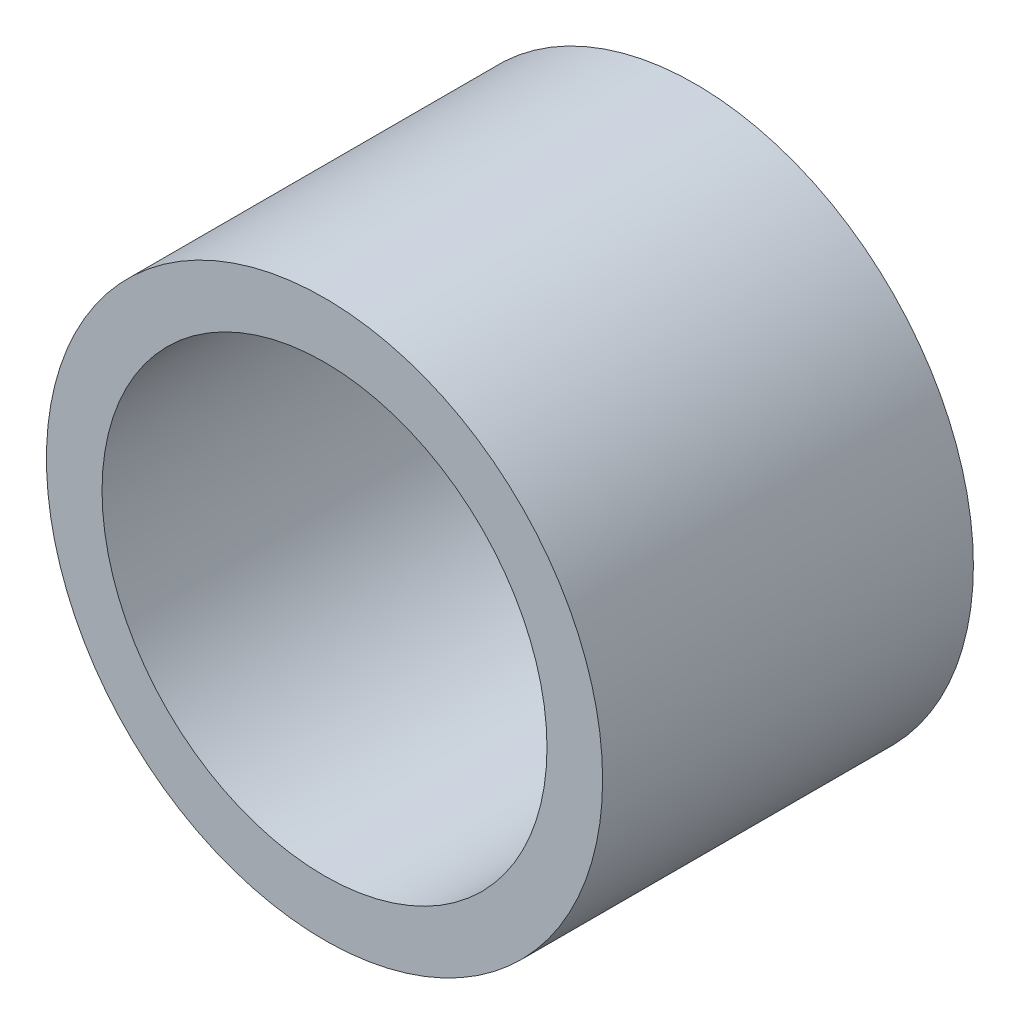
ISO-10303-21;
HEADER;
FILE_DESCRIPTION(('STEP AP214'),'2;1');
FILE_NAME('part.step','',(''),(''),'','','');
FILE_SCHEMA(('AUTOMOTIVE_DESIGN { 1 0 10303 214 1 1 1 1 }'));
ENDSEC;
DATA;
#1=APPLICATION_CONTEXT('core data for automotive mechanical design processes');
#2=APPLICATION_PROTOCOL_DEFINITION('international standard','automotive_design',2000,#1);
#3=PRODUCT_CONTEXT('',#1,'mechanical');
#4=PRODUCT('Part','Part','',(#3));
#5=PRODUCT_RELATED_PRODUCT_CATEGORY('part','',(#4));
#6=PRODUCT_DEFINITION_FORMATION('','',#4);
#7=PRODUCT_DEFINITION_CONTEXT('part definition',#1,'design');
#8=PRODUCT_DEFINITION('design','',#6,#7);
#9=PRODUCT_DEFINITION_SHAPE('','',#8);
#10=(LENGTH_UNIT() NAMED_UNIT(*) SI_UNIT(.MILLI.,.METRE.));
#11=(NAMED_UNIT(*) PLANE_ANGLE_UNIT() SI_UNIT($,.RADIAN.));
#12=(NAMED_UNIT(*) SI_UNIT($,.STERADIAN.) SOLID_ANGLE_UNIT());
#13=UNCERTAINTY_MEASURE_WITH_UNIT(LENGTH_MEASURE(1.E-05),#10,'distance_accuracy_value','');
#14=(GEOMETRIC_REPRESENTATION_CONTEXT(3) GLOBAL_UNCERTAINTY_ASSIGNED_CONTEXT((#13)) GLOBAL_UNIT_ASSIGNED_CONTEXT((#10,
#11,#12)) REPRESENTATION_CONTEXT('',''));
#15=CARTESIAN_POINT('',(0.,0.,0.));
#16=DIRECTION('',(0.,0.,1.));
#17=DIRECTION('',(1.,0.,0.));
#18=AXIS2_PLACEMENT_3D('',#15,#16,#17);
#19=CARTESIAN_POINT('',(0.,0.,25.4));
#20=DIRECTION('',(0.,0.,1.));
#21=DIRECTION('',(1.,0.,0.));
#22=AXIS2_PLACEMENT_3D('',#19,#20,#21);
#23=PLANE('',#22);
#24=CARTESIAN_POINT('',(0.,0.,25.4));
#25=DIRECTION('',(0.,0.,1.));
#26=DIRECTION('',(1.,0.,0.));
#27=AXIS2_PLACEMENT_3D('',#24,#25,#26);
#28=CIRCLE('',#27,38.1);
#29=CARTESIAN_POINT('',(38.1,0.,25.4));
#30=VERTEX_POINT('',#29);
#31=EDGE_CURVE('E10',#30,#30,#28,.T.);
#32=ORIENTED_EDGE('',*,*,#31,.T.);
#33=EDGE_LOOP('',(#32));
#34=FACE_BOUND('',#33,.T.);
#35=CARTESIAN_POINT('',(0.,0.,25.4));
#36=DIRECTION('',(0.,0.,1.));
#37=DIRECTION('',(1.,0.,0.));
#38=AXIS2_PLACEMENT_3D('',#35,#36,#37);
#39=CIRCLE('',#38,30.48);
#40=CARTESIAN_POINT('',(30.48,0.,25.4));
#41=VERTEX_POINT('',#40);
#42=EDGE_CURVE('E46',#41,#41,#39,.T.);
#43=ORIENTED_EDGE('',*,*,#42,.F.);
#44=EDGE_LOOP('',(#43));
#45=FACE_BOUND('',#44,.T.);
#46=ADVANCED_FACE('F35',(#34,#45),#23,.T.);
#47=CARTESIAN_POINT('',(0.,0.,-25.4));
#48=DIRECTION('',(0.,0.,1.));
#49=DIRECTION('',(1.,0.,0.));
#50=AXIS2_PLACEMENT_3D('',#47,#48,#49);
#51=PLANE('',#50);
#52=CARTESIAN_POINT('',(0.,0.,-25.4));
#53=DIRECTION('',(0.,0.,1.));
#54=DIRECTION('',(1.,0.,0.));
#55=AXIS2_PLACEMENT_3D('',#52,#53,#54);
#56=CIRCLE('',#55,38.1);
#57=CARTESIAN_POINT('',(38.1,0.,-25.4));
#58=VERTEX_POINT('',#57);
#59=EDGE_CURVE('E42',#58,#58,#56,.T.);
#60=ORIENTED_EDGE('',*,*,#59,.F.);
#61=EDGE_LOOP('',(#60));
#62=FACE_BOUND('',#61,.T.);
#63=CARTESIAN_POINT('',(0.,0.,-25.4));
#64=DIRECTION('',(0.,0.,1.));
#65=DIRECTION('',(1.,0.,0.));
#66=AXIS2_PLACEMENT_3D('',#63,#64,#65);
#67=CIRCLE('',#66,30.48);
#68=CARTESIAN_POINT('',(30.48,0.,-25.4));
#69=VERTEX_POINT('',#68);
#70=EDGE_CURVE('E50',#69,#69,#67,.T.);
#71=ORIENTED_EDGE('',*,*,#70,.T.);
#72=EDGE_LOOP('',(#71));
#73=FACE_BOUND('',#72,.T.);
#74=ADVANCED_FACE('F56',(#62,#73),#51,.F.);
#75=CARTESIAN_POINT('',(0.,0.,25.4));
#76=DIRECTION('',(0.,0.,-1.));
#77=DIRECTION('',(-1.,0.,0.));
#78=AXIS2_PLACEMENT_3D('',#75,#76,#77);
#79=CYLINDRICAL_SURFACE('',#78,38.1);
#80=ORIENTED_EDGE('',*,*,#31,.F.);
#81=EDGE_LOOP('',(#80));
#82=FACE_BOUND('',#81,.T.);
#83=ORIENTED_EDGE('',*,*,#59,.T.);
#84=EDGE_LOOP('',(#83));
#85=FACE_BOUND('',#84,.T.);
#86=ADVANCED_FACE('F37',(#82,#85),#79,.T.);
#87=CARTESIAN_POINT('',(0.,0.,25.4));
#88=DIRECTION('',(0.,0.,-1.));
#89=DIRECTION('',(-1.,0.,0.));
#90=AXIS2_PLACEMENT_3D('',#87,#88,#89);
#91=CYLINDRICAL_SURFACE('',#90,30.48);
#92=ORIENTED_EDGE('',*,*,#42,.T.);
#93=EDGE_LOOP('',(#92));
#94=FACE_BOUND('',#93,.T.);
#95=ORIENTED_EDGE('',*,*,#70,.F.);
#96=EDGE_LOOP('',(#95));
#97=FACE_BOUND('',#96,.T.);
#98=ADVANCED_FACE('F58',(#94,#97),#91,.F.);
#99=CLOSED_SHELL('',(#46,#74,#86,#98));
#100=MANIFOLD_SOLID_BREP('B2',#99);
#101=ADVANCED_BREP_SHAPE_REPRESENTATION('',(#18,#100),#14);
#102=SHAPE_DEFINITION_REPRESENTATION(#9,#101);
ENDSEC;
END-ISO-10303-21;
